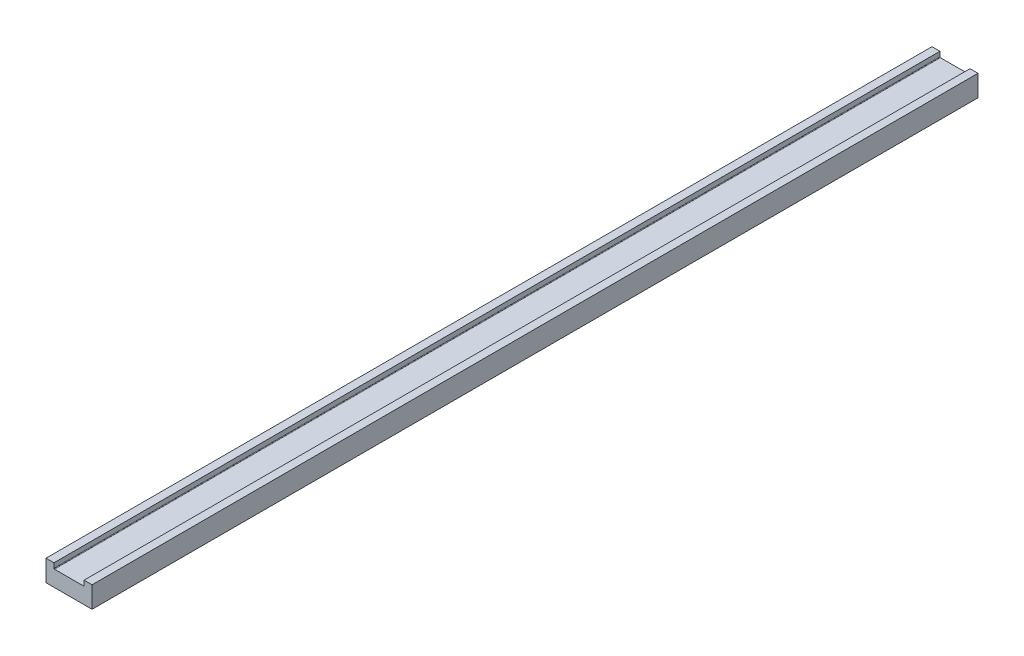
ISO-10303-21;
HEADER;
FILE_DESCRIPTION(('STEP AP214'),'2;1');
FILE_NAME('part.step','',(''),(''),'','','');
FILE_SCHEMA(('AUTOMOTIVE_DESIGN { 1 0 10303 214 1 1 1 1 }'));
ENDSEC;
DATA;
#1=APPLICATION_CONTEXT('core data for automotive mechanical design processes');
#2=APPLICATION_PROTOCOL_DEFINITION('international standard','automotive_design',2000,#1);
#3=PRODUCT_CONTEXT('',#1,'mechanical');
#4=PRODUCT('Part','Part','',(#3));
#5=PRODUCT_RELATED_PRODUCT_CATEGORY('part','',(#4));
#6=PRODUCT_DEFINITION_FORMATION('','',#4);
#7=PRODUCT_DEFINITION_CONTEXT('part definition',#1,'design');
#8=PRODUCT_DEFINITION('design','',#6,#7);
#9=PRODUCT_DEFINITION_SHAPE('','',#8);
#10=(LENGTH_UNIT() NAMED_UNIT(*) SI_UNIT(.MILLI.,.METRE.));
#11=(NAMED_UNIT(*) PLANE_ANGLE_UNIT() SI_UNIT($,.RADIAN.));
#12=(NAMED_UNIT(*) SI_UNIT($,.STERADIAN.) SOLID_ANGLE_UNIT());
#13=UNCERTAINTY_MEASURE_WITH_UNIT(LENGTH_MEASURE(1.E-05),#10,'distance_accuracy_value','');
#14=(GEOMETRIC_REPRESENTATION_CONTEXT(3) GLOBAL_UNCERTAINTY_ASSIGNED_CONTEXT((#13)) GLOBAL_UNIT_ASSIGNED_CONTEXT((#10,
#11,#12)) REPRESENTATION_CONTEXT('',''));
#15=CARTESIAN_POINT('',(0.,0.,0.));
#16=DIRECTION('',(0.,0.,1.));
#17=DIRECTION('',(1.,0.,0.));
#18=AXIS2_PLACEMENT_3D('',#15,#16,#17);
#19=CARTESIAN_POINT('',(8.5,12.,0.));
#20=DIRECTION('',(0.,-1.,0.));
#21=DIRECTION('',(0.,0.,-1.));
#22=AXIS2_PLACEMENT_3D('',#19,#20,#21);
#23=PLANE('',#22);
#24=DIRECTION('',(1.,0.,0.));
#25=VECTOR('',#24,1.);
#26=CARTESIAN_POINT('',(8.5,12.,500.));
#27=LINE('',#26,#25);
#28=CARTESIAN_POINT('',(8.5,12.,500.));
#29=VERTEX_POINT('',#28);
#30=CARTESIAN_POINT('',(13.,12.,500.));
#31=VERTEX_POINT('',#30);
#32=EDGE_CURVE('E123',#29,#31,#27,.T.);
#33=ORIENTED_EDGE('',*,*,#32,.T.);
#34=DIRECTION('',(0.,0.,1.));
#35=VECTOR('',#34,1.);
#36=CARTESIAN_POINT('',(13.,12.,0.));
#37=LINE('',#36,#35);
#38=CARTESIAN_POINT('',(13.,12.,0.));
#39=VERTEX_POINT('',#38);
#40=EDGE_CURVE('E9',#39,#31,#37,.T.);
#41=ORIENTED_EDGE('',*,*,#40,.F.);
#42=DIRECTION('',(1.,0.,0.));
#43=VECTOR('',#42,1.);
#44=CARTESIAN_POINT('',(8.5,12.,0.));
#45=LINE('',#44,#43);
#46=CARTESIAN_POINT('',(8.5,12.,0.));
#47=VERTEX_POINT('',#46);
#48=EDGE_CURVE('E146',#47,#39,#45,.T.);
#49=ORIENTED_EDGE('',*,*,#48,.F.);
#50=DIRECTION('',(0.,0.,1.));
#51=VECTOR('',#50,1.);
#52=CARTESIAN_POINT('',(8.5,12.,0.));
#53=LINE('',#52,#51);
#54=EDGE_CURVE('E30',#47,#29,#53,.T.);
#55=ORIENTED_EDGE('',*,*,#54,.T.);
#56=EDGE_LOOP('',(#33,#41,#49,#55));
#57=FACE_BOUND('',#56,.T.);
#58=ADVANCED_FACE('F14',(#57),#23,.F.);
#59=CARTESIAN_POINT('',(13.,12.,0.));
#60=DIRECTION('',(-1.,0.,0.));
#61=DIRECTION('',(0.,0.,1.));
#62=AXIS2_PLACEMENT_3D('',#59,#60,#61);
#63=PLANE('',#62);
#64=DIRECTION('',(0.,-1.,0.));
#65=VECTOR('',#64,1.);
#66=CARTESIAN_POINT('',(13.,12.,500.));
#67=LINE('',#66,#65);
#68=CARTESIAN_POINT('',(13.,0.,500.));
#69=VERTEX_POINT('',#68);
#70=EDGE_CURVE('E125',#31,#69,#67,.T.);
#71=ORIENTED_EDGE('',*,*,#70,.T.);
#72=DIRECTION('',(0.,0.,1.));
#73=VECTOR('',#72,1.);
#74=CARTESIAN_POINT('',(13.,0.,0.));
#75=LINE('',#74,#73);
#76=CARTESIAN_POINT('',(13.,0.,0.));
#77=VERTEX_POINT('',#76);
#78=EDGE_CURVE('E22',#77,#69,#75,.T.);
#79=ORIENTED_EDGE('',*,*,#78,.F.);
#80=DIRECTION('',(0.,-1.,0.));
#81=VECTOR('',#80,1.);
#82=CARTESIAN_POINT('',(13.,12.,0.));
#83=LINE('',#82,#81);
#84=EDGE_CURVE('E75',#39,#77,#83,.T.);
#85=ORIENTED_EDGE('',*,*,#84,.F.);
#86=ORIENTED_EDGE('',*,*,#40,.T.);
#87=EDGE_LOOP('',(#71,#79,#85,#86));
#88=FACE_BOUND('',#87,.T.);
#89=ADVANCED_FACE('F165',(#88),#63,.F.);
#90=CARTESIAN_POINT('',(-13.,0.,0.));
#91=DIRECTION('',(0.,-1.,0.));
#92=DIRECTION('',(1.,0.,0.));
#93=AXIS2_PLACEMENT_3D('',#90,#91,#92);
#94=PLANE('',#93);
#95=DIRECTION('',(1.,0.,0.));
#96=VECTOR('',#95,1.);
#97=CARTESIAN_POINT('',(-13.,0.,500.));
#98=LINE('',#97,#96);
#99=CARTESIAN_POINT('',(-13.,0.,500.));
#100=VERTEX_POINT('',#99);
#101=EDGE_CURVE('E128',#100,#69,#98,.T.);
#102=ORIENTED_EDGE('',*,*,#101,.F.);
#103=DIRECTION('',(0.,0.,1.));
#104=VECTOR('',#103,1.);
#105=CARTESIAN_POINT('',(-13.,0.,0.));
#106=LINE('',#105,#104);
#107=CARTESIAN_POINT('',(-13.,0.,0.));
#108=VERTEX_POINT('',#107);
#109=EDGE_CURVE('E158',#108,#100,#106,.T.);
#110=ORIENTED_EDGE('',*,*,#109,.F.);
#111=DIRECTION('',(1.,0.,0.));
#112=VECTOR('',#111,1.);
#113=CARTESIAN_POINT('',(-13.,0.,0.));
#114=LINE('',#113,#112);
#115=EDGE_CURVE('E164',#108,#77,#114,.T.);
#116=ORIENTED_EDGE('',*,*,#115,.T.);
#117=ORIENTED_EDGE('',*,*,#78,.T.);
#118=EDGE_LOOP('',(#102,#110,#116,#117));
#119=FACE_BOUND('',#118,.T.);
#120=ADVANCED_FACE('F162',(#119),#94,.T.);
#121=CARTESIAN_POINT('',(-13.,12.,0.));
#122=DIRECTION('',(-1.,0.,0.));
#123=DIRECTION('',(0.,0.,1.));
#124=AXIS2_PLACEMENT_3D('',#121,#122,#123);
#125=PLANE('',#124);
#126=DIRECTION('',(0.,-1.,0.));
#127=VECTOR('',#126,1.);
#128=CARTESIAN_POINT('',(-13.,12.,500.));
#129=LINE('',#128,#127);
#130=CARTESIAN_POINT('',(-13.,12.,500.));
#131=VERTEX_POINT('',#130);
#132=EDGE_CURVE('E131',#131,#100,#129,.T.);
#133=ORIENTED_EDGE('',*,*,#132,.F.);
#134=DIRECTION('',(0.,0.,1.));
#135=VECTOR('',#134,1.);
#136=CARTESIAN_POINT('',(-13.,12.,0.));
#137=LINE('',#136,#135);
#138=CARTESIAN_POINT('',(-13.,12.,0.));
#139=VERTEX_POINT('',#138);
#140=EDGE_CURVE('E156',#139,#131,#137,.T.);
#141=ORIENTED_EDGE('',*,*,#140,.F.);
#142=DIRECTION('',(0.,-1.,0.));
#143=VECTOR('',#142,1.);
#144=CARTESIAN_POINT('',(-13.,12.,0.));
#145=LINE('',#144,#143);
#146=EDGE_CURVE('E177',#139,#108,#145,.T.);
#147=ORIENTED_EDGE('',*,*,#146,.T.);
#148=ORIENTED_EDGE('',*,*,#109,.T.);
#149=EDGE_LOOP('',(#133,#141,#147,#148));
#150=FACE_BOUND('',#149,.T.);
#151=ADVANCED_FACE('F173',(#150),#125,.T.);
#152=CARTESIAN_POINT('',(-13.,12.,0.));
#153=DIRECTION('',(0.,-1.,0.));
#154=DIRECTION('',(0.,0.,-1.));
#155=AXIS2_PLACEMENT_3D('',#152,#153,#154);
#156=PLANE('',#155);
#157=DIRECTION('',(1.,0.,0.));
#158=VECTOR('',#157,1.);
#159=CARTESIAN_POINT('',(-13.,12.,500.));
#160=LINE('',#159,#158);
#161=CARTESIAN_POINT('',(-8.5,12.,500.));
#162=VERTEX_POINT('',#161);
#163=EDGE_CURVE('E134',#131,#162,#160,.T.);
#164=ORIENTED_EDGE('',*,*,#163,.T.);
#165=DIRECTION('',(0.,0.,1.));
#166=VECTOR('',#165,1.);
#167=CARTESIAN_POINT('',(-8.5,12.,0.));
#168=LINE('',#167,#166);
#169=CARTESIAN_POINT('',(-8.5,12.,0.));
#170=VERTEX_POINT('',#169);
#171=EDGE_CURVE('E153',#170,#162,#168,.T.);
#172=ORIENTED_EDGE('',*,*,#171,.F.);
#173=DIRECTION('',(1.,0.,0.));
#174=VECTOR('',#173,1.);
#175=CARTESIAN_POINT('',(-13.,12.,0.));
#176=LINE('',#175,#174);
#177=EDGE_CURVE('E179',#139,#170,#176,.T.);
#178=ORIENTED_EDGE('',*,*,#177,.F.);
#179=ORIENTED_EDGE('',*,*,#140,.T.);
#180=EDGE_LOOP('',(#164,#172,#178,#179));
#181=FACE_BOUND('',#180,.T.);
#182=ADVANCED_FACE('F219',(#181),#156,.F.);
#183=CARTESIAN_POINT('',(-8.5,12.,0.));
#184=DIRECTION('',(-1.,0.,0.));
#185=DIRECTION('',(0.,0.,1.));
#186=AXIS2_PLACEMENT_3D('',#183,#184,#185);
#187=PLANE('',#186);
#188=DIRECTION('',(0.,-1.,0.));
#189=VECTOR('',#188,1.);
#190=CARTESIAN_POINT('',(-8.5,12.,500.));
#191=LINE('',#190,#189);
#192=CARTESIAN_POINT('',(-8.5,9.29999999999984,500.));
#193=VERTEX_POINT('',#192);
#194=EDGE_CURVE('E136',#162,#193,#191,.T.);
#195=ORIENTED_EDGE('',*,*,#194,.T.);
#196=DIRECTION('',(0.,0.,1.));
#197=VECTOR('',#196,1.);
#198=CARTESIAN_POINT('',(-8.5,9.29999999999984,0.));
#199=LINE('',#198,#197);
#200=CARTESIAN_POINT('',(-8.5,9.29999999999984,0.));
#201=VERTEX_POINT('',#200);
#202=EDGE_CURVE('E150',#201,#193,#199,.T.);
#203=ORIENTED_EDGE('',*,*,#202,.F.);
#204=DIRECTION('',(0.,-1.,0.));
#205=VECTOR('',#204,1.);
#206=CARTESIAN_POINT('',(-8.5,12.,0.));
#207=LINE('',#206,#205);
#208=EDGE_CURVE('E185',#170,#201,#207,.T.);
#209=ORIENTED_EDGE('',*,*,#208,.F.);
#210=ORIENTED_EDGE('',*,*,#171,.T.);
#211=EDGE_LOOP('',(#195,#203,#209,#210));
#212=FACE_BOUND('',#211,.T.);
#213=ADVANCED_FACE('F190',(#212),#187,.F.);
#214=CARTESIAN_POINT('',(-8.2,9.29999999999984,0.));
#215=DIRECTION('',(0.,0.,1.));
#216=DIRECTION('',(1.,0.,0.));
#217=AXIS2_PLACEMENT_3D('',#214,#215,#216);
#218=CYLINDRICAL_SURFACE('',#217,0.3);
#219=CARTESIAN_POINT('',(-8.2,9.29999999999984,500.));
#220=DIRECTION('',(0.,0.,1.));
#221=DIRECTION('',(1.,0.,0.));
#222=AXIS2_PLACEMENT_3D('',#219,#220,#221);
#223=CIRCLE('',#222,0.3);
#224=CARTESIAN_POINT('',(-8.2,8.99999999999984,500.));
#225=VERTEX_POINT('',#224);
#226=EDGE_CURVE('E138',#193,#225,#223,.T.);
#227=ORIENTED_EDGE('',*,*,#226,.T.);
#228=DIRECTION('',(0.,0.,1.));
#229=VECTOR('',#228,1.);
#230=CARTESIAN_POINT('',(-8.2,8.99999999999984,0.));
#231=LINE('',#230,#229);
#232=CARTESIAN_POINT('',(-8.2,8.99999999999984,0.));
#233=VERTEX_POINT('',#232);
#234=EDGE_CURVE('E115',#233,#225,#231,.T.);
#235=ORIENTED_EDGE('',*,*,#234,.F.);
#236=CARTESIAN_POINT('',(-8.2,9.29999999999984,0.));
#237=DIRECTION('',(0.,0.,1.));
#238=DIRECTION('',(1.,0.,0.));
#239=AXIS2_PLACEMENT_3D('',#236,#237,#238);
#240=CIRCLE('',#239,0.3);
#241=EDGE_CURVE('E103',#201,#233,#240,.T.);
#242=ORIENTED_EDGE('',*,*,#241,.F.);
#243=ORIENTED_EDGE('',*,*,#202,.T.);
#244=EDGE_LOOP('',(#227,#235,#242,#243));
#245=FACE_BOUND('',#244,.T.);
#246=ADVANCED_FACE('F193',(#245),#218,.F.);
#247=CARTESIAN_POINT('',(-8.2,8.99999999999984,0.));
#248=DIRECTION('',(0.,-1.,0.));
#249=DIRECTION('',(1.,0.,0.));
#250=AXIS2_PLACEMENT_3D('',#247,#248,#249);
#251=PLANE('',#250);
#252=DIRECTION('',(1.,0.,0.));
#253=VECTOR('',#252,1.);
#254=CARTESIAN_POINT('',(-8.2,8.99999999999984,500.));
#255=LINE('',#254,#253);
#256=CARTESIAN_POINT('',(8.2,8.99999999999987,500.));
#257=VERTEX_POINT('',#256);
#258=EDGE_CURVE('E112',#225,#257,#255,.T.);
#259=ORIENTED_EDGE('',*,*,#258,.T.);
#260=DIRECTION('',(0.,0.,1.));
#261=VECTOR('',#260,1.);
#262=CARTESIAN_POINT('',(8.2,8.99999999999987,0.));
#263=LINE('',#262,#261);
#264=CARTESIAN_POINT('',(8.2,8.99999999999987,0.));
#265=VERTEX_POINT('',#264);
#266=EDGE_CURVE('E109',#265,#257,#263,.T.);
#267=ORIENTED_EDGE('',*,*,#266,.F.);
#268=DIRECTION('',(1.,0.,0.));
#269=VECTOR('',#268,1.);
#270=CARTESIAN_POINT('',(-8.2,8.99999999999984,0.));
#271=LINE('',#270,#269);
#272=EDGE_CURVE('E96',#233,#265,#271,.T.);
#273=ORIENTED_EDGE('',*,*,#272,.F.);
#274=ORIENTED_EDGE('',*,*,#234,.T.);
#275=EDGE_LOOP('',(#259,#267,#273,#274));
#276=FACE_BOUND('',#275,.T.);
#277=ADVANCED_FACE('F110',(#276),#251,.F.);
#278=CARTESIAN_POINT('',(8.2,9.29999999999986,0.));
#279=DIRECTION('',(0.,0.,1.));
#280=DIRECTION('',(1.,0.,0.));
#281=AXIS2_PLACEMENT_3D('',#278,#279,#280);
#282=CYLINDRICAL_SURFACE('',#281,0.299999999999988);
#283=CARTESIAN_POINT('',(8.2,9.29999999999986,500.));
#284=DIRECTION('',(0.,0.,1.));
#285=DIRECTION('',(1.,0.,0.));
#286=AXIS2_PLACEMENT_3D('',#283,#284,#285);
#287=CIRCLE('',#286,0.299999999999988);
#288=CARTESIAN_POINT('',(8.5,9.29999999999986,500.));
#289=VERTEX_POINT('',#288);
#290=EDGE_CURVE('E141',#257,#289,#287,.T.);
#291=ORIENTED_EDGE('',*,*,#290,.T.);
#292=DIRECTION('',(0.,0.,1.));
#293=VECTOR('',#292,1.);
#294=CARTESIAN_POINT('',(8.5,9.29999999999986,0.));
#295=LINE('',#294,#293);
#296=CARTESIAN_POINT('',(8.5,9.29999999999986,0.));
#297=VERTEX_POINT('',#296);
#298=EDGE_CURVE('E63',#297,#289,#295,.T.);
#299=ORIENTED_EDGE('',*,*,#298,.F.);
#300=CARTESIAN_POINT('',(8.2,9.29999999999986,0.));
#301=DIRECTION('',(0.,0.,1.));
#302=DIRECTION('',(1.,0.,0.));
#303=AXIS2_PLACEMENT_3D('',#300,#301,#302);
#304=CIRCLE('',#303,0.299999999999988);
#305=EDGE_CURVE('E101',#265,#297,#304,.T.);
#306=ORIENTED_EDGE('',*,*,#305,.F.);
#307=ORIENTED_EDGE('',*,*,#266,.T.);
#308=EDGE_LOOP('',(#291,#299,#306,#307));
#309=FACE_BOUND('',#308,.T.);
#310=ADVANCED_FACE('F117',(#309),#282,.F.);
#311=CARTESIAN_POINT('',(8.5,12.,0.));
#312=DIRECTION('',(-1.,0.,0.));
#313=DIRECTION('',(0.,0.,1.));
#314=AXIS2_PLACEMENT_3D('',#311,#312,#313);
#315=PLANE('',#314);
#316=DIRECTION('',(0.,-1.,0.));
#317=VECTOR('',#316,1.);
#318=CARTESIAN_POINT('',(8.5,12.,500.));
#319=LINE('',#318,#317);
#320=EDGE_CURVE('E143',#29,#289,#319,.T.);
#321=ORIENTED_EDGE('',*,*,#320,.F.);
#322=ORIENTED_EDGE('',*,*,#54,.F.);
#323=DIRECTION('',(0.,-1.,0.));
#324=VECTOR('',#323,1.);
#325=CARTESIAN_POINT('',(8.5,12.,0.));
#326=LINE('',#325,#324);
#327=EDGE_CURVE('E118',#47,#297,#326,.T.);
#328=ORIENTED_EDGE('',*,*,#327,.T.);
#329=ORIENTED_EDGE('',*,*,#298,.T.);
#330=EDGE_LOOP('',(#321,#322,#328,#329));
#331=FACE_BOUND('',#330,.T.);
#332=ADVANCED_FACE('F194',(#331),#315,.T.);
#333=CARTESIAN_POINT('',(-8.2,9.29999999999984,0.));
#334=DIRECTION('',(0.,0.,1.));
#335=DIRECTION('',(1.,0.,0.));
#336=AXIS2_PLACEMENT_3D('',#333,#334,#335);
#337=PLANE('',#336);
#338=ORIENTED_EDGE('',*,*,#48,.T.);
#339=ORIENTED_EDGE('',*,*,#84,.T.);
#340=ORIENTED_EDGE('',*,*,#115,.F.);
#341=ORIENTED_EDGE('',*,*,#146,.F.);
#342=ORIENTED_EDGE('',*,*,#177,.T.);
#343=ORIENTED_EDGE('',*,*,#208,.T.);
#344=ORIENTED_EDGE('',*,*,#241,.T.);
#345=ORIENTED_EDGE('',*,*,#272,.T.);
#346=ORIENTED_EDGE('',*,*,#305,.T.);
#347=ORIENTED_EDGE('',*,*,#327,.F.);
#348=EDGE_LOOP('',(#338,#339,#340,#341,#342,#343,#344,#345,#346,#347));
#349=FACE_BOUND('',#348,.T.);
#350=ADVANCED_FACE('F98',(#349),#337,.F.);
#351=CARTESIAN_POINT('',(-8.2,9.29999999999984,500.));
#352=DIRECTION('',(0.,0.,1.));
#353=DIRECTION('',(1.,0.,0.));
#354=AXIS2_PLACEMENT_3D('',#351,#352,#353);
#355=PLANE('',#354);
#356=ORIENTED_EDGE('',*,*,#32,.F.);
#357=ORIENTED_EDGE('',*,*,#320,.T.);
#358=ORIENTED_EDGE('',*,*,#290,.F.);
#359=ORIENTED_EDGE('',*,*,#258,.F.);
#360=ORIENTED_EDGE('',*,*,#226,.F.);
#361=ORIENTED_EDGE('',*,*,#194,.F.);
#362=ORIENTED_EDGE('',*,*,#163,.F.);
#363=ORIENTED_EDGE('',*,*,#132,.T.);
#364=ORIENTED_EDGE('',*,*,#101,.T.);
#365=ORIENTED_EDGE('',*,*,#70,.F.);
#366=EDGE_LOOP('',(#356,#357,#358,#359,#360,#361,#362,#363,#364,#365));
#367=FACE_BOUND('',#366,.T.);
#368=ADVANCED_FACE('F168',(#367),#355,.T.);
#369=CLOSED_SHELL('',(#58,#89,#120,#151,#182,#213,#246,#277,#310,#332,#350,#368));
#370=MANIFOLD_SOLID_BREP('B1',#369);
#371=ADVANCED_BREP_SHAPE_REPRESENTATION('',(#18,#370),#14);
#372=SHAPE_DEFINITION_REPRESENTATION(#9,#371);
ENDSEC;
END-ISO-10303-21;
